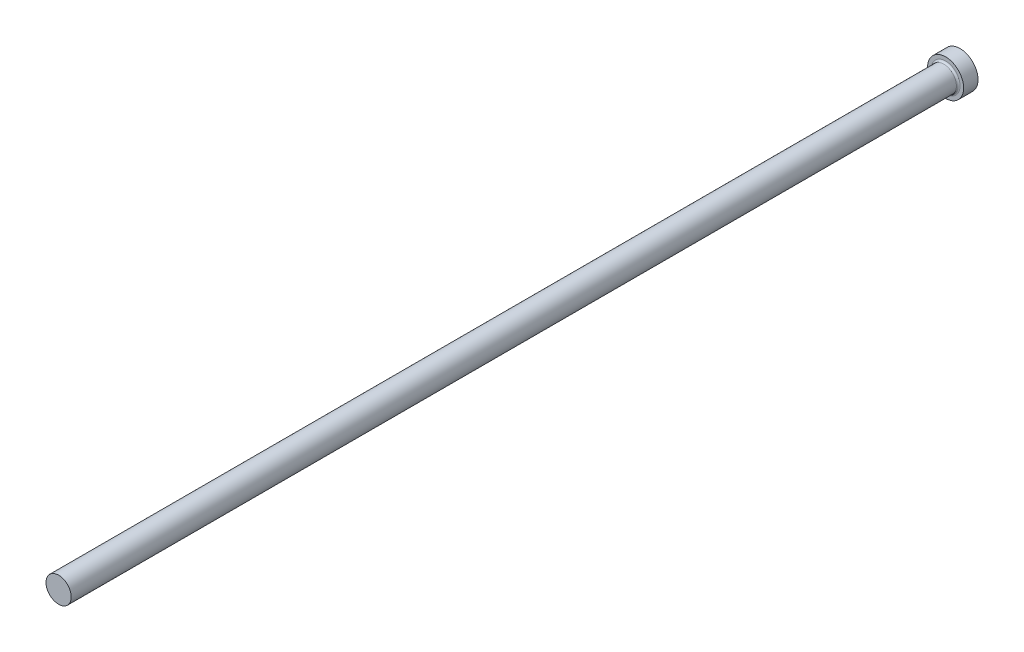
ISO-10303-21;
HEADER;
FILE_DESCRIPTION(('STEP AP214'),'2;1');
FILE_NAME('part.step','',(''),(''),'','','');
FILE_SCHEMA(('AUTOMOTIVE_DESIGN { 1 0 10303 214 1 1 1 1 }'));
ENDSEC;
DATA;
#1=APPLICATION_CONTEXT('core data for automotive mechanical design processes');
#2=APPLICATION_PROTOCOL_DEFINITION('international standard','automotive_design',2000,#1);
#3=PRODUCT_CONTEXT('',#1,'mechanical');
#4=PRODUCT('Part','Part','',(#3));
#5=PRODUCT_RELATED_PRODUCT_CATEGORY('part','',(#4));
#6=PRODUCT_DEFINITION_FORMATION('','',#4);
#7=PRODUCT_DEFINITION_CONTEXT('part definition',#1,'design');
#8=PRODUCT_DEFINITION('design','',#6,#7);
#9=PRODUCT_DEFINITION_SHAPE('','',#8);
#10=(LENGTH_UNIT() NAMED_UNIT(*) SI_UNIT(.MILLI.,.METRE.));
#11=(NAMED_UNIT(*) PLANE_ANGLE_UNIT() SI_UNIT($,.RADIAN.));
#12=(NAMED_UNIT(*) SI_UNIT($,.STERADIAN.) SOLID_ANGLE_UNIT());
#13=UNCERTAINTY_MEASURE_WITH_UNIT(LENGTH_MEASURE(1.E-05),#10,'distance_accuracy_value','');
#14=(GEOMETRIC_REPRESENTATION_CONTEXT(3) GLOBAL_UNCERTAINTY_ASSIGNED_CONTEXT((#13)) GLOBAL_UNIT_ASSIGNED_CONTEXT((#10,
#11,#12)) REPRESENTATION_CONTEXT('',''));
#15=CARTESIAN_POINT('',(0.,0.,0.));
#16=DIRECTION('',(0.,0.,1.));
#17=DIRECTION('',(1.,0.,0.));
#18=AXIS2_PLACEMENT_3D('',#15,#16,#17);
#19=CARTESIAN_POINT('',(5.,0.,4.));
#20=DIRECTION('',(0.,0.,-1.));
#21=DIRECTION('',(-1.,0.,0.));
#22=AXIS2_PLACEMENT_3D('',#19,#20,#21);
#23=PLANE('',#22);
#24=CARTESIAN_POINT('',(0.,0.,4.));
#25=DIRECTION('',(0.,0.,-1.));
#26=DIRECTION('',(-1.,0.,0.));
#27=AXIS2_PLACEMENT_3D('',#24,#25,#26);
#28=CIRCLE('',#27,4.00000000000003);
#29=CARTESIAN_POINT('',(-4.00000000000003,0.,4.));
#30=VERTEX_POINT('',#29);
#31=EDGE_CURVE('E40',#30,#30,#28,.T.);
#32=ORIENTED_EDGE('',*,*,#31,.T.);
#33=EDGE_LOOP('',(#32));
#34=FACE_BOUND('',#33,.T.);
#35=CARTESIAN_POINT('',(0.,0.,4.));
#36=DIRECTION('',(0.,0.,-1.));
#37=DIRECTION('',(-1.,0.,0.));
#38=AXIS2_PLACEMENT_3D('',#35,#36,#37);
#39=CIRCLE('',#38,5.);
#40=CARTESIAN_POINT('',(-5.,0.,4.));
#41=VERTEX_POINT('',#40);
#42=EDGE_CURVE('E44',#41,#41,#39,.T.);
#43=ORIENTED_EDGE('',*,*,#42,.F.);
#44=EDGE_LOOP('',(#43));
#45=FACE_BOUND('',#44,.T.);
#46=ADVANCED_FACE('F33',(#34,#45),#23,.F.);
#47=CARTESIAN_POINT('',(0.,0.,-9.03322817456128));
#48=DIRECTION('',(0.,0.,-1.));
#49=DIRECTION('',(-1.,0.,0.));
#50=AXIS2_PLACEMENT_3D('',#47,#48,#49);
#51=CYLINDRICAL_SURFACE('',#50,5.);
#52=CARTESIAN_POINT('',(0.,0.,0.));
#53=DIRECTION('',(0.,0.,-1.));
#54=DIRECTION('',(-1.,0.,0.));
#55=AXIS2_PLACEMENT_3D('',#52,#53,#54);
#56=CIRCLE('',#55,5.);
#57=CARTESIAN_POINT('',(-5.,0.,0.));
#58=VERTEX_POINT('',#57);
#59=EDGE_CURVE('E48',#58,#58,#56,.T.);
#60=ORIENTED_EDGE('',*,*,#59,.F.);
#61=EDGE_LOOP('',(#60));
#62=FACE_BOUND('',#61,.T.);
#63=ORIENTED_EDGE('',*,*,#42,.T.);
#64=EDGE_LOOP('',(#63));
#65=FACE_BOUND('',#64,.T.);
#66=ADVANCED_FACE('F68',(#62,#65),#51,.T.);
#67=CARTESIAN_POINT('',(0.,0.,0.));
#68=DIRECTION('',(0.,0.,1.));
#69=DIRECTION('',(1.,0.,0.));
#70=AXIS2_PLACEMENT_3D('',#67,#68,#69);
#71=PLANE('',#70);
#72=ORIENTED_EDGE('',*,*,#59,.T.);
#73=EDGE_LOOP('',(#72));
#74=FACE_BOUND('',#73,.T.);
#75=ADVANCED_FACE('F61',(#74),#71,.F.);
#76=CARTESIAN_POINT('',(0.,0.,250.));
#77=DIRECTION('',(0.,0.,-1.));
#78=DIRECTION('',(-1.,0.,0.));
#79=AXIS2_PLACEMENT_3D('',#76,#77,#78);
#80=PLANE('',#79);
#81=CARTESIAN_POINT('',(0.,0.,250.));
#82=DIRECTION('',(0.,0.,-1.));
#83=DIRECTION('',(-1.,0.,0.));
#84=AXIS2_PLACEMENT_3D('',#81,#82,#83);
#85=CIRCLE('',#84,3.50000000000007);
#86=CARTESIAN_POINT('',(-3.50000000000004,0.,250.));
#87=VERTEX_POINT('',#86);
#88=EDGE_CURVE('E53',#87,#87,#85,.T.);
#89=ORIENTED_EDGE('',*,*,#88,.F.);
#90=EDGE_LOOP('',(#89));
#91=FACE_BOUND('',#90,.T.);
#92=ADVANCED_FACE('F59',(#91),#80,.F.);
#93=CARTESIAN_POINT('',(0.,0.,-9.03322817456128));
#94=DIRECTION('',(0.,0.,-1.));
#95=DIRECTION('',(-1.,0.,0.));
#96=AXIS2_PLACEMENT_3D('',#93,#94,#95);
#97=CYLINDRICAL_SURFACE('',#96,3.50000000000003);
#98=CARTESIAN_POINT('',(0.,0.,4.5));
#99=DIRECTION('',(0.,0.,-1.));
#100=DIRECTION('',(-1.,0.,0.));
#101=AXIS2_PLACEMENT_3D('',#98,#99,#100);
#102=CIRCLE('',#101,3.50000000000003);
#103=CARTESIAN_POINT('',(-3.50000000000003,0.,4.5));
#104=VERTEX_POINT('',#103);
#105=EDGE_CURVE('E10',#104,#104,#102,.F.);
#106=ORIENTED_EDGE('',*,*,#105,.T.);
#107=EDGE_LOOP('',(#106));
#108=FACE_BOUND('',#107,.T.);
#109=ORIENTED_EDGE('',*,*,#88,.T.);
#110=EDGE_LOOP('',(#109));
#111=FACE_BOUND('',#110,.T.);
#112=ADVANCED_FACE('F57',(#108,#111),#97,.T.);
#113=CARTESIAN_POINT('',(0.,0.,4.5));
#114=DIRECTION('',(0.,0.,-1.));
#115=DIRECTION('',(-1.,0.,0.));
#116=AXIS2_PLACEMENT_3D('',#113,#114,#115);
#117=TOROIDAL_SURFACE('',#116,4.00000000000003,0.5);
#118=ORIENTED_EDGE('',*,*,#105,.F.);
#119=EDGE_LOOP('',(#118));
#120=FACE_BOUND('',#119,.T.);
#121=ORIENTED_EDGE('',*,*,#31,.F.);
#122=EDGE_LOOP('',(#121));
#123=FACE_BOUND('',#122,.T.);
#124=ADVANCED_FACE('F35',(#120,#123),#117,.F.);
#125=CLOSED_SHELL('',(#46,#66,#75,#92,#112,#124));
#126=MANIFOLD_SOLID_BREP('B2',#125);
#127=ADVANCED_BREP_SHAPE_REPRESENTATION('',(#18,#126),#14);
#128=SHAPE_DEFINITION_REPRESENTATION(#9,#127);
ENDSEC;
END-ISO-10303-21;
